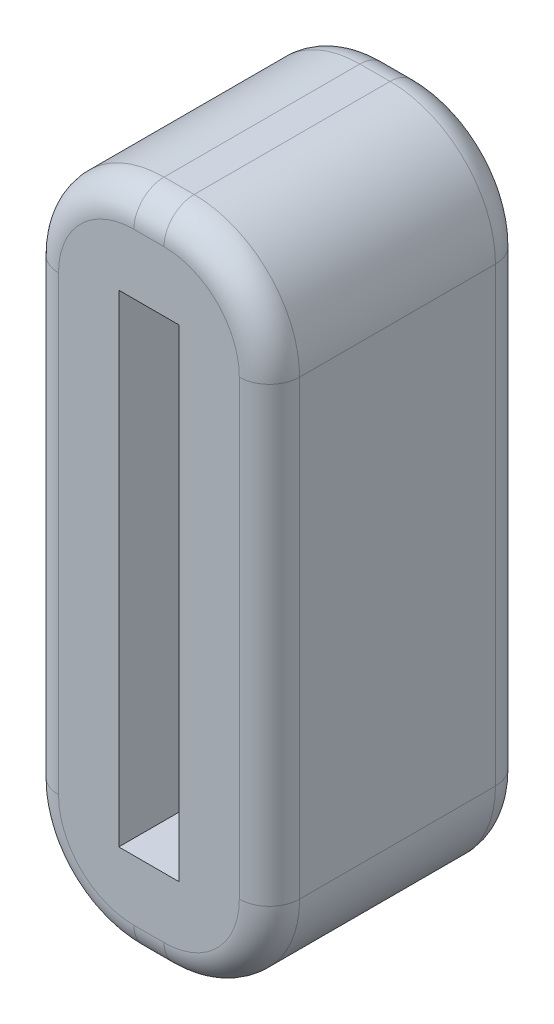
ISO-10303-21;
HEADER;
FILE_DESCRIPTION(('STEP AP214'),'2;1');
FILE_NAME('part.step','',(''),(''),'','','');
FILE_SCHEMA(('AUTOMOTIVE_DESIGN { 1 0 10303 214 1 1 1 1 }'));
ENDSEC;
DATA;
#1=APPLICATION_CONTEXT('core data for automotive mechanical design processes');
#2=APPLICATION_PROTOCOL_DEFINITION('international standard','automotive_design',2000,#1);
#3=PRODUCT_CONTEXT('',#1,'mechanical');
#4=PRODUCT('Part','Part','',(#3));
#5=PRODUCT_RELATED_PRODUCT_CATEGORY('part','',(#4));
#6=PRODUCT_DEFINITION_FORMATION('','',#4);
#7=PRODUCT_DEFINITION_CONTEXT('part definition',#1,'design');
#8=PRODUCT_DEFINITION('design','',#6,#7);
#9=PRODUCT_DEFINITION_SHAPE('','',#8);
#10=(LENGTH_UNIT() NAMED_UNIT(*) SI_UNIT(.MILLI.,.METRE.));
#11=(NAMED_UNIT(*) PLANE_ANGLE_UNIT() SI_UNIT($,.RADIAN.));
#12=(NAMED_UNIT(*) SI_UNIT($,.STERADIAN.) SOLID_ANGLE_UNIT());
#13=UNCERTAINTY_MEASURE_WITH_UNIT(LENGTH_MEASURE(1.E-05),#10,'distance_accuracy_value','');
#14=(GEOMETRIC_REPRESENTATION_CONTEXT(3) GLOBAL_UNCERTAINTY_ASSIGNED_CONTEXT((#13)) GLOBAL_UNIT_ASSIGNED_CONTEXT((#10,
#11,#12)) REPRESENTATION_CONTEXT('',''));
#15=CARTESIAN_POINT('',(0.,0.,0.));
#16=DIRECTION('',(0.,0.,1.));
#17=DIRECTION('',(1.,0.,0.));
#18=AXIS2_PLACEMENT_3D('',#15,#16,#17);
#19=CARTESIAN_POINT('',(0.749999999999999,0.249999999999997,4.25));
#20=DIRECTION('',(0.,0.,-1.));
#21=DIRECTION('',(-1.,0.,0.));
#22=AXIS2_PLACEMENT_3D('',#19,#20,#21);
#23=PLANE('',#22);
#24=DIRECTION('',(1.,0.,0.));
#25=VECTOR('',#24,1.);
#26=CARTESIAN_POINT('',(0.749999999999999,-1.,4.25));
#27=LINE('',#26,#25);
#28=CARTESIAN_POINT('',(0.250000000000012,-1.,4.25));
#29=VERTEX_POINT('',#28);
#30=CARTESIAN_POINT('',(0.74999999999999,-1.,4.25));
#31=VERTEX_POINT('',#30);
#32=EDGE_CURVE('E49',#29,#31,#27,.T.);
#33=ORIENTED_EDGE('',*,*,#32,.T.);
#34=CARTESIAN_POINT('',(0.749999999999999,0.249999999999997,4.25));
#35=DIRECTION('',(0.,0.,-1.));
#36=DIRECTION('',(-1.,0.,0.));
#37=AXIS2_PLACEMENT_3D('',#34,#35,#36);
#38=CIRCLE('',#37,1.25);
#39=CARTESIAN_POINT('',(2.,0.250000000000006,4.25));
#40=VERTEX_POINT('',#39);
#41=EDGE_CURVE('E295',#31,#40,#38,.F.);
#42=ORIENTED_EDGE('',*,*,#41,.T.);
#43=DIRECTION('',(0.,1.,0.));
#44=VECTOR('',#43,1.);
#45=CARTESIAN_POINT('',(2.,0.249999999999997,4.25));
#46=LINE('',#45,#44);
#47=CARTESIAN_POINT('',(2.,7.74999999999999,4.25));
#48=VERTEX_POINT('',#47);
#49=EDGE_CURVE('E283',#40,#48,#46,.T.);
#50=ORIENTED_EDGE('',*,*,#49,.T.);
#51=CARTESIAN_POINT('',(0.749999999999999,7.75,4.25));
#52=DIRECTION('',(0.,0.,-1.));
#53=DIRECTION('',(-1.,0.,0.));
#54=AXIS2_PLACEMENT_3D('',#51,#52,#53);
#55=CIRCLE('',#54,1.25);
#56=CARTESIAN_POINT('',(0.749999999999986,9.,4.25));
#57=VERTEX_POINT('',#56);
#58=EDGE_CURVE('E285',#48,#57,#55,.F.);
#59=ORIENTED_EDGE('',*,*,#58,.T.);
#60=DIRECTION('',(-1.,0.,0.));
#61=VECTOR('',#60,1.);
#62=CARTESIAN_POINT('',(0.749999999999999,9.,4.25));
#63=LINE('',#62,#61);
#64=CARTESIAN_POINT('',(0.250000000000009,9.,4.25));
#65=VERTEX_POINT('',#64);
#66=EDGE_CURVE('E287',#57,#65,#63,.T.);
#67=ORIENTED_EDGE('',*,*,#66,.T.);
#68=CARTESIAN_POINT('',(0.25,7.75,4.25));
#69=DIRECTION('',(0.,0.,-1.));
#70=DIRECTION('',(-1.,0.,0.));
#71=AXIS2_PLACEMENT_3D('',#68,#69,#70);
#72=CIRCLE('',#71,1.25);
#73=CARTESIAN_POINT('',(-1.,7.74999999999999,4.25));
#74=VERTEX_POINT('',#73);
#75=EDGE_CURVE('E289',#65,#74,#72,.F.);
#76=ORIENTED_EDGE('',*,*,#75,.T.);
#77=DIRECTION('',(0.,-1.,0.));
#78=VECTOR('',#77,1.);
#79=CARTESIAN_POINT('',(-1.,0.249999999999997,4.25));
#80=LINE('',#79,#78);
#81=CARTESIAN_POINT('',(-1.,0.250000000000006,4.25));
#82=VERTEX_POINT('',#81);
#83=EDGE_CURVE('E291',#74,#82,#80,.T.);
#84=ORIENTED_EDGE('',*,*,#83,.T.);
#85=CARTESIAN_POINT('',(0.25,0.249999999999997,4.25));
#86=DIRECTION('',(0.,0.,-1.));
#87=DIRECTION('',(-1.,0.,0.));
#88=AXIS2_PLACEMENT_3D('',#85,#86,#87);
#89=CIRCLE('',#88,1.25);
#90=EDGE_CURVE('E54',#82,#29,#89,.F.);
#91=ORIENTED_EDGE('',*,*,#90,.T.);
#92=EDGE_LOOP('',(#33,#42,#50,#59,#67,#76,#84,#91));
#93=FACE_BOUND('',#92,.T.);
#94=DIRECTION('',(1.,0.,0.));
#95=VECTOR('',#94,1.);
#96=CARTESIAN_POINT('',(1.,0.,4.25));
#97=LINE('',#96,#95);
#98=CARTESIAN_POINT('',(0.,0.,4.25));
#99=VERTEX_POINT('',#98);
#100=CARTESIAN_POINT('',(1.,0.,4.25));
#101=VERTEX_POINT('',#100);
#102=EDGE_CURVE('E171',#99,#101,#97,.T.);
#103=ORIENTED_EDGE('',*,*,#102,.F.);
#104=DIRECTION('',(0.,-1.,0.));
#105=VECTOR('',#104,1.);
#106=CARTESIAN_POINT('',(0.,0.,4.25));
#107=LINE('',#106,#105);
#108=CARTESIAN_POINT('',(0.,8.,4.25));
#109=VERTEX_POINT('',#108);
#110=EDGE_CURVE('E196',#109,#99,#107,.T.);
#111=ORIENTED_EDGE('',*,*,#110,.F.);
#112=DIRECTION('',(-1.,0.,0.));
#113=VECTOR('',#112,1.);
#114=CARTESIAN_POINT('',(0.,8.,4.25));
#115=LINE('',#114,#113);
#116=CARTESIAN_POINT('',(0.999999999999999,8.,4.25));
#117=VERTEX_POINT('',#116);
#118=EDGE_CURVE('E194',#117,#109,#115,.T.);
#119=ORIENTED_EDGE('',*,*,#118,.F.);
#120=DIRECTION('',(0.,1.,0.));
#121=VECTOR('',#120,1.);
#122=CARTESIAN_POINT('',(0.999999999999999,8.,4.25));
#123=LINE('',#122,#121);
#124=EDGE_CURVE('E181',#101,#117,#123,.T.);
#125=ORIENTED_EDGE('',*,*,#124,.F.);
#126=EDGE_LOOP('',(#103,#111,#119,#125));
#127=FACE_BOUND('',#126,.T.);
#128=ADVANCED_FACE('F32',(#93,#127),#23,.F.);
#129=CARTESIAN_POINT('',(0.749999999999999,0.249999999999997,0.));
#130=DIRECTION('',(0.,0.,-1.));
#131=DIRECTION('',(-1.,0.,0.));
#132=AXIS2_PLACEMENT_3D('',#129,#130,#131);
#133=PLANE('',#132);
#134=DIRECTION('',(0.,1.,0.));
#135=VECTOR('',#134,1.);
#136=CARTESIAN_POINT('',(2.,0.250000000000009,0.));
#137=LINE('',#136,#135);
#138=CARTESIAN_POINT('',(2.,7.74999999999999,0.));
#139=VERTEX_POINT('',#138);
#140=CARTESIAN_POINT('',(2.,0.250000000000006,0.));
#141=VERTEX_POINT('',#140);
#142=EDGE_CURVE('E242',#139,#141,#137,.F.);
#143=ORIENTED_EDGE('',*,*,#142,.T.);
#144=CARTESIAN_POINT('',(0.749999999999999,0.249999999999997,0.));
#145=DIRECTION('',(0.,0.,-1.));
#146=DIRECTION('',(-1.,0.,0.));
#147=AXIS2_PLACEMENT_3D('',#144,#145,#146);
#148=CIRCLE('',#147,1.25);
#149=CARTESIAN_POINT('',(0.74999999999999,-1.,0.));
#150=VERTEX_POINT('',#149);
#151=EDGE_CURVE('E256',#141,#150,#148,.T.);
#152=ORIENTED_EDGE('',*,*,#151,.T.);
#153=DIRECTION('',(1.,0.,0.));
#154=VECTOR('',#153,1.);
#155=CARTESIAN_POINT('',(0.250000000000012,-1.,0.));
#156=LINE('',#155,#154);
#157=CARTESIAN_POINT('',(0.250000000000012,-1.,0.));
#158=VERTEX_POINT('',#157);
#159=EDGE_CURVE('E254',#150,#158,#156,.F.);
#160=ORIENTED_EDGE('',*,*,#159,.T.);
#161=CARTESIAN_POINT('',(0.25,0.249999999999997,0.));
#162=DIRECTION('',(0.,0.,-1.));
#163=DIRECTION('',(-1.,0.,0.));
#164=AXIS2_PLACEMENT_3D('',#161,#162,#163);
#165=CIRCLE('',#164,1.25);
#166=CARTESIAN_POINT('',(-1.,0.250000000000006,0.));
#167=VERTEX_POINT('',#166);
#168=EDGE_CURVE('E252',#158,#167,#165,.T.);
#169=ORIENTED_EDGE('',*,*,#168,.T.);
#170=DIRECTION('',(0.,-1.,0.));
#171=VECTOR('',#170,1.);
#172=CARTESIAN_POINT('',(-1.,7.74999999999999,0.));
#173=LINE('',#172,#171);
#174=CARTESIAN_POINT('',(-1.,7.74999999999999,0.));
#175=VERTEX_POINT('',#174);
#176=EDGE_CURVE('E250',#167,#175,#173,.F.);
#177=ORIENTED_EDGE('',*,*,#176,.T.);
#178=CARTESIAN_POINT('',(0.25,7.75,0.));
#179=DIRECTION('',(0.,0.,-1.));
#180=DIRECTION('',(-1.,0.,0.));
#181=AXIS2_PLACEMENT_3D('',#178,#179,#180);
#182=CIRCLE('',#181,1.25);
#183=CARTESIAN_POINT('',(0.250000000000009,9.,0.));
#184=VERTEX_POINT('',#183);
#185=EDGE_CURVE('E248',#175,#184,#182,.T.);
#186=ORIENTED_EDGE('',*,*,#185,.T.);
#187=DIRECTION('',(-1.,0.,0.));
#188=VECTOR('',#187,1.);
#189=CARTESIAN_POINT('',(0.749999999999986,9.,0.));
#190=LINE('',#189,#188);
#191=CARTESIAN_POINT('',(0.749999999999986,9.,0.));
#192=VERTEX_POINT('',#191);
#193=EDGE_CURVE('E246',#184,#192,#190,.F.);
#194=ORIENTED_EDGE('',*,*,#193,.T.);
#195=CARTESIAN_POINT('',(0.749999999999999,7.75,0.));
#196=DIRECTION('',(0.,0.,-1.));
#197=DIRECTION('',(-1.,0.,0.));
#198=AXIS2_PLACEMENT_3D('',#195,#196,#197);
#199=CIRCLE('',#198,1.25);
#200=EDGE_CURVE('E244',#192,#139,#199,.T.);
#201=ORIENTED_EDGE('',*,*,#200,.T.);
#202=EDGE_LOOP('',(#143,#152,#160,#169,#177,#186,#194,#201));
#203=FACE_BOUND('',#202,.T.);
#204=DIRECTION('',(0.,-1.,0.));
#205=VECTOR('',#204,1.);
#206=CARTESIAN_POINT('',(0.,0.,0.));
#207=LINE('',#206,#205);
#208=CARTESIAN_POINT('',(0.,8.,0.));
#209=VERTEX_POINT('',#208);
#210=CARTESIAN_POINT('',(0.,0.,0.));
#211=VERTEX_POINT('',#210);
#212=EDGE_CURVE('E182',#209,#211,#207,.T.);
#213=ORIENTED_EDGE('',*,*,#212,.T.);
#214=DIRECTION('',(1.,0.,0.));
#215=VECTOR('',#214,1.);
#216=CARTESIAN_POINT('',(1.,0.,0.));
#217=LINE('',#216,#215);
#218=CARTESIAN_POINT('',(1.,0.,0.));
#219=VERTEX_POINT('',#218);
#220=EDGE_CURVE('E200',#211,#219,#217,.T.);
#221=ORIENTED_EDGE('',*,*,#220,.T.);
#222=DIRECTION('',(0.,1.,0.));
#223=VECTOR('',#222,1.);
#224=CARTESIAN_POINT('',(0.999999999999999,8.,0.));
#225=LINE('',#224,#223);
#226=CARTESIAN_POINT('',(0.999999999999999,8.,0.));
#227=VERTEX_POINT('',#226);
#228=EDGE_CURVE('E188',#219,#227,#225,.T.);
#229=ORIENTED_EDGE('',*,*,#228,.T.);
#230=DIRECTION('',(-1.,0.,0.));
#231=VECTOR('',#230,1.);
#232=CARTESIAN_POINT('',(0.,8.,0.));
#233=LINE('',#232,#231);
#234=EDGE_CURVE('E204',#227,#209,#233,.T.);
#235=ORIENTED_EDGE('',*,*,#234,.T.);
#236=EDGE_LOOP('',(#213,#221,#229,#235));
#237=FACE_BOUND('',#236,.T.);
#238=ADVANCED_FACE('F371',(#203,#237),#133,.T.);
#239=CARTESIAN_POINT('',(0.749999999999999,0.249999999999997,4.25));
#240=DIRECTION('',(0.,0.,-1.));
#241=DIRECTION('',(-1.,0.,0.));
#242=AXIS2_PLACEMENT_3D('',#239,#240,#241);
#243=CYLINDRICAL_SURFACE('',#242,1.75);
#244=DIRECTION('',(0.,0.,-1.));
#245=VECTOR('',#244,1.);
#246=CARTESIAN_POINT('',(0.749999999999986,-1.5,4.25));
#247=LINE('',#246,#245);
#248=CARTESIAN_POINT('',(0.749999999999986,-1.5,3.75));
#249=VERTEX_POINT('',#248);
#250=CARTESIAN_POINT('',(0.749999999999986,-1.5,0.5));
#251=VERTEX_POINT('',#250);
#252=EDGE_CURVE('E189',#249,#251,#247,.T.);
#253=ORIENTED_EDGE('',*,*,#252,.T.);
#254=CARTESIAN_POINT('',(0.749999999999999,0.249999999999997,0.5));
#255=DIRECTION('',(0.,0.,-1.));
#256=DIRECTION('',(-1.,0.,0.));
#257=AXIS2_PLACEMENT_3D('',#254,#255,#256);
#258=CIRCLE('',#257,1.75);
#259=CARTESIAN_POINT('',(2.5,0.250000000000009,0.5));
#260=VERTEX_POINT('',#259);
#261=EDGE_CURVE('E239',#251,#260,#258,.F.);
#262=ORIENTED_EDGE('',*,*,#261,.T.);
#263=DIRECTION('',(0.,0.,-1.));
#264=VECTOR('',#263,1.);
#265=CARTESIAN_POINT('',(2.5,0.250000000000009,4.25));
#266=LINE('',#265,#264);
#267=CARTESIAN_POINT('',(2.5,0.250000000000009,3.75));
#268=VERTEX_POINT('',#267);
#269=EDGE_CURVE('E233',#268,#260,#266,.T.);
#270=ORIENTED_EDGE('',*,*,#269,.F.);
#271=CARTESIAN_POINT('',(0.749999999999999,0.249999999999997,3.75));
#272=DIRECTION('',(0.,0.,-1.));
#273=DIRECTION('',(-1.,0.,0.));
#274=AXIS2_PLACEMENT_3D('',#271,#272,#273);
#275=CIRCLE('',#274,1.75);
#276=EDGE_CURVE('E236',#268,#249,#275,.T.);
#277=ORIENTED_EDGE('',*,*,#276,.T.);
#278=EDGE_LOOP('',(#253,#262,#270,#277));
#279=FACE_BOUND('',#278,.T.);
#280=ADVANCED_FACE('F405',(#279),#243,.T.);
#281=CARTESIAN_POINT('',(2.5,7.74999999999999,4.25));
#282=DIRECTION('',(-1.,0.,0.));
#283=DIRECTION('',(0.,0.,1.));
#284=AXIS2_PLACEMENT_3D('',#281,#282,#283);
#285=PLANE('',#284);
#286=ORIENTED_EDGE('',*,*,#269,.T.);
#287=DIRECTION('',(0.,1.,0.));
#288=VECTOR('',#287,1.);
#289=CARTESIAN_POINT('',(2.5,7.74999999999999,0.5));
#290=LINE('',#289,#288);
#291=CARTESIAN_POINT('',(2.5,7.74999999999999,0.5));
#292=VERTEX_POINT('',#291);
#293=EDGE_CURVE('E11',#260,#292,#290,.T.);
#294=ORIENTED_EDGE('',*,*,#293,.T.);
#295=DIRECTION('',(0.,0.,-1.));
#296=VECTOR('',#295,1.);
#297=CARTESIAN_POINT('',(2.5,7.74999999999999,4.25));
#298=LINE('',#297,#296);
#299=CARTESIAN_POINT('',(2.5,7.74999999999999,3.75));
#300=VERTEX_POINT('',#299);
#301=EDGE_CURVE('E230',#300,#292,#298,.T.);
#302=ORIENTED_EDGE('',*,*,#301,.F.);
#303=DIRECTION('',(0.,1.,0.));
#304=VECTOR('',#303,1.);
#305=CARTESIAN_POINT('',(2.5,7.74999999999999,3.75));
#306=LINE('',#305,#304);
#307=EDGE_CURVE('E41',#300,#268,#306,.F.);
#308=ORIENTED_EDGE('',*,*,#307,.T.);
#309=EDGE_LOOP('',(#286,#294,#302,#308));
#310=FACE_BOUND('',#309,.T.);
#311=ADVANCED_FACE('F441',(#310),#285,.F.);
#312=CARTESIAN_POINT('',(0.749999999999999,7.75,4.25));
#313=DIRECTION('',(0.,0.,-1.));
#314=DIRECTION('',(-1.,0.,0.));
#315=AXIS2_PLACEMENT_3D('',#312,#313,#314);
#316=CYLINDRICAL_SURFACE('',#315,1.75);
#317=ORIENTED_EDGE('',*,*,#301,.T.);
#318=CARTESIAN_POINT('',(0.749999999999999,7.75,0.5));
#319=DIRECTION('',(0.,0.,-1.));
#320=DIRECTION('',(-1.,0.,0.));
#321=AXIS2_PLACEMENT_3D('',#318,#319,#320);
#322=CIRCLE('',#321,1.75);
#323=CARTESIAN_POINT('',(0.749999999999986,9.5,0.5));
#324=VERTEX_POINT('',#323);
#325=EDGE_CURVE('E281',#292,#324,#322,.F.);
#326=ORIENTED_EDGE('',*,*,#325,.T.);
#327=DIRECTION('',(0.,0.,-1.));
#328=VECTOR('',#327,1.);
#329=CARTESIAN_POINT('',(0.749999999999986,9.5,4.25));
#330=LINE('',#329,#328);
#331=CARTESIAN_POINT('',(0.749999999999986,9.5,3.75));
#332=VERTEX_POINT('',#331);
#333=EDGE_CURVE('E227',#332,#324,#330,.T.);
#334=ORIENTED_EDGE('',*,*,#333,.F.);
#335=CARTESIAN_POINT('',(0.749999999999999,7.75,3.75));
#336=DIRECTION('',(0.,0.,-1.));
#337=DIRECTION('',(-1.,0.,0.));
#338=AXIS2_PLACEMENT_3D('',#335,#336,#337);
#339=CIRCLE('',#338,1.75);
#340=EDGE_CURVE('E279',#332,#300,#339,.T.);
#341=ORIENTED_EDGE('',*,*,#340,.T.);
#342=EDGE_LOOP('',(#317,#326,#334,#341));
#343=FACE_BOUND('',#342,.T.);
#344=ADVANCED_FACE('F438',(#343),#316,.T.);
#345=CARTESIAN_POINT('',(0.250000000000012,9.5,4.25));
#346=DIRECTION('',(0.,-1.,0.));
#347=DIRECTION('',(0.,0.,-1.));
#348=AXIS2_PLACEMENT_3D('',#345,#346,#347);
#349=PLANE('',#348);
#350=ORIENTED_EDGE('',*,*,#333,.T.);
#351=DIRECTION('',(-1.,0.,0.));
#352=VECTOR('',#351,1.);
#353=CARTESIAN_POINT('',(0.250000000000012,9.5,0.5));
#354=LINE('',#353,#352);
#355=CARTESIAN_POINT('',(0.250000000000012,9.5,0.5));
#356=VERTEX_POINT('',#355);
#357=EDGE_CURVE('E277',#324,#356,#354,.T.);
#358=ORIENTED_EDGE('',*,*,#357,.T.);
#359=DIRECTION('',(0.,0.,-1.));
#360=VECTOR('',#359,1.);
#361=CARTESIAN_POINT('',(0.250000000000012,9.5,4.25));
#362=LINE('',#361,#360);
#363=CARTESIAN_POINT('',(0.250000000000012,9.5,3.75));
#364=VERTEX_POINT('',#363);
#365=EDGE_CURVE('E224',#364,#356,#362,.T.);
#366=ORIENTED_EDGE('',*,*,#365,.F.);
#367=DIRECTION('',(-1.,0.,0.));
#368=VECTOR('',#367,1.);
#369=CARTESIAN_POINT('',(0.250000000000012,9.5,3.75));
#370=LINE('',#369,#368);
#371=EDGE_CURVE('E275',#364,#332,#370,.F.);
#372=ORIENTED_EDGE('',*,*,#371,.T.);
#373=EDGE_LOOP('',(#350,#358,#366,#372));
#374=FACE_BOUND('',#373,.T.);
#375=ADVANCED_FACE('F356',(#374),#349,.F.);
#376=CARTESIAN_POINT('',(0.25,7.75,4.25));
#377=DIRECTION('',(0.,0.,-1.));
#378=DIRECTION('',(-1.,0.,0.));
#379=AXIS2_PLACEMENT_3D('',#376,#377,#378);
#380=CYLINDRICAL_SURFACE('',#379,1.75);
#381=ORIENTED_EDGE('',*,*,#365,.T.);
#382=CARTESIAN_POINT('',(0.25,7.75,0.5));
#383=DIRECTION('',(0.,0.,-1.));
#384=DIRECTION('',(-1.,0.,0.));
#385=AXIS2_PLACEMENT_3D('',#382,#383,#384);
#386=CIRCLE('',#385,1.75);
#387=CARTESIAN_POINT('',(-1.5,7.74999999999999,0.5));
#388=VERTEX_POINT('',#387);
#389=EDGE_CURVE('E273',#356,#388,#386,.F.);
#390=ORIENTED_EDGE('',*,*,#389,.T.);
#391=DIRECTION('',(0.,0.,-1.));
#392=VECTOR('',#391,1.);
#393=CARTESIAN_POINT('',(-1.5,7.74999999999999,4.25));
#394=LINE('',#393,#392);
#395=CARTESIAN_POINT('',(-1.5,7.74999999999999,3.75));
#396=VERTEX_POINT('',#395);
#397=EDGE_CURVE('E221',#396,#388,#394,.T.);
#398=ORIENTED_EDGE('',*,*,#397,.F.);
#399=CARTESIAN_POINT('',(0.25,7.75,3.75));
#400=DIRECTION('',(0.,0.,-1.));
#401=DIRECTION('',(-1.,0.,0.));
#402=AXIS2_PLACEMENT_3D('',#399,#400,#401);
#403=CIRCLE('',#402,1.75);
#404=EDGE_CURVE('E271',#396,#364,#403,.T.);
#405=ORIENTED_EDGE('',*,*,#404,.T.);
#406=EDGE_LOOP('',(#381,#390,#398,#405));
#407=FACE_BOUND('',#406,.T.);
#408=ADVANCED_FACE('F353',(#407),#380,.T.);
#409=CARTESIAN_POINT('',(-1.5,0.250000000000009,4.25));
#410=DIRECTION('',(1.,0.,0.));
#411=DIRECTION('',(0.,0.,-1.));
#412=AXIS2_PLACEMENT_3D('',#409,#410,#411);
#413=PLANE('',#412);
#414=ORIENTED_EDGE('',*,*,#397,.T.);
#415=DIRECTION('',(0.,-1.,0.));
#416=VECTOR('',#415,1.);
#417=CARTESIAN_POINT('',(-1.5,0.250000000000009,0.5));
#418=LINE('',#417,#416);
#419=CARTESIAN_POINT('',(-1.5,0.250000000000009,0.5));
#420=VERTEX_POINT('',#419);
#421=EDGE_CURVE('E269',#388,#420,#418,.T.);
#422=ORIENTED_EDGE('',*,*,#421,.T.);
#423=DIRECTION('',(0.,0.,-1.));
#424=VECTOR('',#423,1.);
#425=CARTESIAN_POINT('',(-1.5,0.250000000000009,4.25));
#426=LINE('',#425,#424);
#427=CARTESIAN_POINT('',(-1.5,0.250000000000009,3.75));
#428=VERTEX_POINT('',#427);
#429=EDGE_CURVE('E218',#428,#420,#426,.T.);
#430=ORIENTED_EDGE('',*,*,#429,.F.);
#431=DIRECTION('',(0.,-1.,0.));
#432=VECTOR('',#431,1.);
#433=CARTESIAN_POINT('',(-1.5,0.250000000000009,3.75));
#434=LINE('',#433,#432);
#435=EDGE_CURVE('E267',#428,#396,#434,.F.);
#436=ORIENTED_EDGE('',*,*,#435,.T.);
#437=EDGE_LOOP('',(#414,#422,#430,#436));
#438=FACE_BOUND('',#437,.T.);
#439=ADVANCED_FACE('F381',(#438),#413,.F.);
#440=CARTESIAN_POINT('',(0.25,0.249999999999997,4.25));
#441=DIRECTION('',(0.,0.,-1.));
#442=DIRECTION('',(-1.,0.,0.));
#443=AXIS2_PLACEMENT_3D('',#440,#441,#442);
#444=CYLINDRICAL_SURFACE('',#443,1.75);
#445=ORIENTED_EDGE('',*,*,#429,.T.);
#446=CARTESIAN_POINT('',(0.25,0.249999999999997,0.5));
#447=DIRECTION('',(0.,0.,-1.));
#448=DIRECTION('',(-1.,0.,0.));
#449=AXIS2_PLACEMENT_3D('',#446,#447,#448);
#450=CIRCLE('',#449,1.75);
#451=CARTESIAN_POINT('',(0.250000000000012,-1.5,0.5));
#452=VERTEX_POINT('',#451);
#453=EDGE_CURVE('E265',#420,#452,#450,.F.);
#454=ORIENTED_EDGE('',*,*,#453,.T.);
#455=DIRECTION('',(0.,0.,-1.));
#456=VECTOR('',#455,1.);
#457=CARTESIAN_POINT('',(0.250000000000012,-1.5,4.25));
#458=LINE('',#457,#456);
#459=CARTESIAN_POINT('',(0.250000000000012,-1.5,3.75));
#460=VERTEX_POINT('',#459);
#461=EDGE_CURVE('E215',#460,#452,#458,.T.);
#462=ORIENTED_EDGE('',*,*,#461,.F.);
#463=CARTESIAN_POINT('',(0.25,0.249999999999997,3.75));
#464=DIRECTION('',(0.,0.,-1.));
#465=DIRECTION('',(-1.,0.,0.));
#466=AXIS2_PLACEMENT_3D('',#463,#464,#465);
#467=CIRCLE('',#466,1.75);
#468=EDGE_CURVE('E263',#460,#428,#467,.T.);
#469=ORIENTED_EDGE('',*,*,#468,.T.);
#470=EDGE_LOOP('',(#445,#454,#462,#469));
#471=FACE_BOUND('',#470,.T.);
#472=ADVANCED_FACE('F385',(#471),#444,.T.);
#473=CARTESIAN_POINT('',(0.749999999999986,-1.5,4.25));
#474=DIRECTION('',(0.,1.,0.));
#475=DIRECTION('',(0.,0.,1.));
#476=AXIS2_PLACEMENT_3D('',#473,#474,#475);
#477=PLANE('',#476);
#478=ORIENTED_EDGE('',*,*,#461,.T.);
#479=DIRECTION('',(1.,0.,0.));
#480=VECTOR('',#479,1.);
#481=CARTESIAN_POINT('',(0.749999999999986,-1.5,0.5));
#482=LINE('',#481,#480);
#483=EDGE_CURVE('E261',#452,#251,#482,.T.);
#484=ORIENTED_EDGE('',*,*,#483,.T.);
#485=ORIENTED_EDGE('',*,*,#252,.F.);
#486=DIRECTION('',(1.,0.,0.));
#487=VECTOR('',#486,1.);
#488=CARTESIAN_POINT('',(0.749999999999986,-1.5,3.75));
#489=LINE('',#488,#487);
#490=EDGE_CURVE('E259',#249,#460,#489,.F.);
#491=ORIENTED_EDGE('',*,*,#490,.T.);
#492=EDGE_LOOP('',(#478,#484,#485,#491));
#493=FACE_BOUND('',#492,.T.);
#494=ADVANCED_FACE('F403',(#493),#477,.F.);
#495=CARTESIAN_POINT('',(1.,0.,4.25));
#496=DIRECTION('',(0.,1.,0.));
#497=DIRECTION('',(-1.,0.,0.));
#498=AXIS2_PLACEMENT_3D('',#495,#496,#497);
#499=PLANE('',#498);
#500=ORIENTED_EDGE('',*,*,#220,.F.);
#501=DIRECTION('',(0.,0.,-1.));
#502=VECTOR('',#501,1.);
#503=CARTESIAN_POINT('',(0.,0.,4.25));
#504=LINE('',#503,#502);
#505=EDGE_CURVE('E177',#99,#211,#504,.T.);
#506=ORIENTED_EDGE('',*,*,#505,.F.);
#507=ORIENTED_EDGE('',*,*,#102,.T.);
#508=DIRECTION('',(0.,0.,-1.));
#509=VECTOR('',#508,1.);
#510=CARTESIAN_POINT('',(1.,0.,4.25));
#511=LINE('',#510,#509);
#512=EDGE_CURVE('E174',#101,#219,#511,.T.);
#513=ORIENTED_EDGE('',*,*,#512,.T.);
#514=EDGE_LOOP('',(#500,#506,#507,#513));
#515=FACE_BOUND('',#514,.T.);
#516=ADVANCED_FACE('F173',(#515),#499,.T.);
#517=CARTESIAN_POINT('',(0.999999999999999,8.,4.25));
#518=DIRECTION('',(-1.,0.,0.));
#519=DIRECTION('',(0.,-1.,0.));
#520=AXIS2_PLACEMENT_3D('',#517,#518,#519);
#521=PLANE('',#520);
#522=ORIENTED_EDGE('',*,*,#228,.F.);
#523=ORIENTED_EDGE('',*,*,#512,.F.);
#524=ORIENTED_EDGE('',*,*,#124,.T.);
#525=DIRECTION('',(0.,0.,-1.));
#526=VECTOR('',#525,1.);
#527=CARTESIAN_POINT('',(0.999999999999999,8.,4.25));
#528=LINE('',#527,#526);
#529=EDGE_CURVE('E190',#117,#227,#528,.T.);
#530=ORIENTED_EDGE('',*,*,#529,.T.);
#531=EDGE_LOOP('',(#522,#523,#524,#530));
#532=FACE_BOUND('',#531,.T.);
#533=ADVANCED_FACE('F185',(#532),#521,.T.);
#534=CARTESIAN_POINT('',(0.,8.,4.25));
#535=DIRECTION('',(0.,-1.,0.));
#536=DIRECTION('',(0.,0.,-1.));
#537=AXIS2_PLACEMENT_3D('',#534,#535,#536);
#538=PLANE('',#537);
#539=ORIENTED_EDGE('',*,*,#234,.F.);
#540=ORIENTED_EDGE('',*,*,#529,.F.);
#541=ORIENTED_EDGE('',*,*,#118,.T.);
#542=DIRECTION('',(0.,0.,-1.));
#543=VECTOR('',#542,1.);
#544=CARTESIAN_POINT('',(0.,8.,4.25));
#545=LINE('',#544,#543);
#546=EDGE_CURVE('E210',#109,#209,#545,.T.);
#547=ORIENTED_EDGE('',*,*,#546,.T.);
#548=EDGE_LOOP('',(#539,#540,#541,#547));
#549=FACE_BOUND('',#548,.T.);
#550=ADVANCED_FACE('F532',(#549),#538,.T.);
#551=CARTESIAN_POINT('',(0.,0.,4.25));
#552=DIRECTION('',(1.,0.,0.));
#553=DIRECTION('',(0.,0.,-1.));
#554=AXIS2_PLACEMENT_3D('',#551,#552,#553);
#555=PLANE('',#554);
#556=ORIENTED_EDGE('',*,*,#212,.F.);
#557=ORIENTED_EDGE('',*,*,#546,.F.);
#558=ORIENTED_EDGE('',*,*,#110,.T.);
#559=ORIENTED_EDGE('',*,*,#505,.T.);
#560=EDGE_LOOP('',(#556,#557,#558,#559));
#561=FACE_BOUND('',#560,.T.);
#562=ADVANCED_FACE('F468',(#561),#555,.T.);
#563=CARTESIAN_POINT('',(0.25,7.75,0.5));
#564=DIRECTION('',(0.,0.,-1.));
#565=DIRECTION('',(-1.,0.,0.));
#566=AXIS2_PLACEMENT_3D('',#563,#564,#565);
#567=TOROIDAL_SURFACE('',#566,1.25,0.5);
#568=CARTESIAN_POINT('',(0.250000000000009,9.,0.5));
#569=DIRECTION('',(1.,0.,0.));
#570=DIRECTION('',(0.,1.,0.));
#571=AXIS2_PLACEMENT_3D('',#568,#569,#570);
#572=CIRCLE('',#571,0.5);
#573=EDGE_CURVE('E314',#184,#356,#572,.T.);
#574=ORIENTED_EDGE('',*,*,#573,.F.);
#575=ORIENTED_EDGE('',*,*,#185,.F.);
#576=CARTESIAN_POINT('',(-1.,7.74999999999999,0.5));
#577=DIRECTION('',(0.,-1.,0.));
#578=DIRECTION('',(0.,0.,-1.));
#579=AXIS2_PLACEMENT_3D('',#576,#577,#578);
#580=CIRCLE('',#579,0.5);
#581=EDGE_CURVE('E202',#388,#175,#580,.T.);
#582=ORIENTED_EDGE('',*,*,#581,.F.);
#583=ORIENTED_EDGE('',*,*,#389,.F.);
#584=EDGE_LOOP('',(#574,#575,#582,#583));
#585=FACE_BOUND('',#584,.T.);
#586=ADVANCED_FACE('F378',(#585),#567,.T.);
#587=CARTESIAN_POINT('',(-1.,0.250000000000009,0.5));
#588=DIRECTION('',(0.,1.,0.));
#589=DIRECTION('',(0.,0.,1.));
#590=AXIS2_PLACEMENT_3D('',#587,#588,#589);
#591=CYLINDRICAL_SURFACE('',#590,0.5);
#592=ORIENTED_EDGE('',*,*,#581,.T.);
#593=ORIENTED_EDGE('',*,*,#176,.F.);
#594=CARTESIAN_POINT('',(-1.,0.250000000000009,0.5));
#595=DIRECTION('',(0.,-1.,0.));
#596=DIRECTION('',(0.,0.,-1.));
#597=AXIS2_PLACEMENT_3D('',#594,#595,#596);
#598=CIRCLE('',#597,0.5);
#599=EDGE_CURVE('E311',#420,#167,#598,.T.);
#600=ORIENTED_EDGE('',*,*,#599,.F.);
#601=ORIENTED_EDGE('',*,*,#421,.F.);
#602=EDGE_LOOP('',(#592,#593,#600,#601));
#603=FACE_BOUND('',#602,.T.);
#604=ADVANCED_FACE('F390',(#603),#591,.T.);
#605=CARTESIAN_POINT('',(0.250000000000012,9.,0.5));
#606=DIRECTION('',(1.,0.,0.));
#607=DIRECTION('',(0.,0.,-1.));
#608=AXIS2_PLACEMENT_3D('',#605,#606,#607);
#609=CYLINDRICAL_SURFACE('',#608,0.5);
#610=ORIENTED_EDGE('',*,*,#573,.T.);
#611=ORIENTED_EDGE('',*,*,#357,.F.);
#612=CARTESIAN_POINT('',(0.749999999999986,9.,0.5));
#613=DIRECTION('',(1.,0.,0.));
#614=DIRECTION('',(0.,0.,-1.));
#615=AXIS2_PLACEMENT_3D('',#612,#613,#614);
#616=CIRCLE('',#615,0.5);
#617=EDGE_CURVE('E308',#192,#324,#616,.T.);
#618=ORIENTED_EDGE('',*,*,#617,.F.);
#619=ORIENTED_EDGE('',*,*,#193,.F.);
#620=EDGE_LOOP('',(#610,#611,#618,#619));
#621=FACE_BOUND('',#620,.T.);
#622=ADVANCED_FACE('F361',(#621),#609,.T.);
#623=CARTESIAN_POINT('',(0.25,0.249999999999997,0.5));
#624=DIRECTION('',(0.,0.,-1.));
#625=DIRECTION('',(-1.,0.,0.));
#626=AXIS2_PLACEMENT_3D('',#623,#624,#625);
#627=TOROIDAL_SURFACE('',#626,1.25,0.5);
#628=ORIENTED_EDGE('',*,*,#599,.T.);
#629=ORIENTED_EDGE('',*,*,#168,.F.);
#630=CARTESIAN_POINT('',(0.250000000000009,-1.,0.5));
#631=DIRECTION('',(1.,0.,0.));
#632=DIRECTION('',(0.,0.,-1.));
#633=AXIS2_PLACEMENT_3D('',#630,#631,#632);
#634=CIRCLE('',#633,0.5);
#635=EDGE_CURVE('E305',#452,#158,#634,.T.);
#636=ORIENTED_EDGE('',*,*,#635,.F.);
#637=ORIENTED_EDGE('',*,*,#453,.F.);
#638=EDGE_LOOP('',(#628,#629,#636,#637));
#639=FACE_BOUND('',#638,.T.);
#640=ADVANCED_FACE('F394',(#639),#627,.T.);
#641=CARTESIAN_POINT('',(0.749999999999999,7.75,0.5));
#642=DIRECTION('',(0.,0.,-1.));
#643=DIRECTION('',(-1.,0.,0.));
#644=AXIS2_PLACEMENT_3D('',#641,#642,#643);
#645=TOROIDAL_SURFACE('',#644,1.25,0.5);
#646=ORIENTED_EDGE('',*,*,#617,.T.);
#647=ORIENTED_EDGE('',*,*,#325,.F.);
#648=CARTESIAN_POINT('',(2.,7.74999999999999,0.5));
#649=DIRECTION('',(0.,-1.,0.));
#650=DIRECTION('',(1.,0.,0.));
#651=AXIS2_PLACEMENT_3D('',#648,#649,#650);
#652=CIRCLE('',#651,0.5);
#653=EDGE_CURVE('E302',#139,#292,#652,.T.);
#654=ORIENTED_EDGE('',*,*,#653,.F.);
#655=ORIENTED_EDGE('',*,*,#200,.F.);
#656=EDGE_LOOP('',(#646,#647,#654,#655));
#657=FACE_BOUND('',#656,.T.);
#658=ADVANCED_FACE('F367',(#657),#645,.T.);
#659=CARTESIAN_POINT('',(0.749999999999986,-1.,0.5));
#660=DIRECTION('',(-1.,0.,0.));
#661=DIRECTION('',(0.,0.,1.));
#662=AXIS2_PLACEMENT_3D('',#659,#660,#661);
#663=CYLINDRICAL_SURFACE('',#662,0.5);
#664=ORIENTED_EDGE('',*,*,#635,.T.);
#665=ORIENTED_EDGE('',*,*,#159,.F.);
#666=CARTESIAN_POINT('',(0.749999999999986,-1.,0.5));
#667=DIRECTION('',(1.,0.,0.));
#668=DIRECTION('',(0.,0.,-1.));
#669=AXIS2_PLACEMENT_3D('',#666,#667,#668);
#670=CIRCLE('',#669,0.5);
#671=EDGE_CURVE('E300',#251,#150,#670,.T.);
#672=ORIENTED_EDGE('',*,*,#671,.F.);
#673=ORIENTED_EDGE('',*,*,#483,.F.);
#674=EDGE_LOOP('',(#664,#665,#672,#673));
#675=FACE_BOUND('',#674,.T.);
#676=ADVANCED_FACE('F399',(#675),#663,.T.);
#677=CARTESIAN_POINT('',(2.,7.74999999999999,0.5));
#678=DIRECTION('',(0.,-1.,0.));
#679=DIRECTION('',(0.,0.,-1.));
#680=AXIS2_PLACEMENT_3D('',#677,#678,#679);
#681=CYLINDRICAL_SURFACE('',#680,0.5);
#682=ORIENTED_EDGE('',*,*,#653,.T.);
#683=ORIENTED_EDGE('',*,*,#293,.F.);
#684=CARTESIAN_POINT('',(2.,0.250000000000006,0.5));
#685=DIRECTION('',(0.,-1.,0.));
#686=DIRECTION('',(1.,0.,0.));
#687=AXIS2_PLACEMENT_3D('',#684,#685,#686);
#688=CIRCLE('',#687,0.5);
#689=EDGE_CURVE('E298',#141,#260,#688,.T.);
#690=ORIENTED_EDGE('',*,*,#689,.F.);
#691=ORIENTED_EDGE('',*,*,#142,.F.);
#692=EDGE_LOOP('',(#682,#683,#690,#691));
#693=FACE_BOUND('',#692,.T.);
#694=ADVANCED_FACE('F451',(#693),#681,.T.);
#695=CARTESIAN_POINT('',(0.749999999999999,0.249999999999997,0.5));
#696=DIRECTION('',(0.,0.,-1.));
#697=DIRECTION('',(-1.,0.,0.));
#698=AXIS2_PLACEMENT_3D('',#695,#696,#697);
#699=TOROIDAL_SURFACE('',#698,1.25,0.5);
#700=ORIENTED_EDGE('',*,*,#671,.T.);
#701=ORIENTED_EDGE('',*,*,#151,.F.);
#702=ORIENTED_EDGE('',*,*,#689,.T.);
#703=ORIENTED_EDGE('',*,*,#261,.F.);
#704=EDGE_LOOP('',(#700,#701,#702,#703));
#705=FACE_BOUND('',#704,.T.);
#706=ADVANCED_FACE('F448',(#705),#699,.T.);
#707=CARTESIAN_POINT('',(0.25,7.75,3.75));
#708=DIRECTION('',(0.,0.,-1.));
#709=DIRECTION('',(-1.,0.,0.));
#710=AXIS2_PLACEMENT_3D('',#707,#708,#709);
#711=TOROIDAL_SURFACE('',#710,1.25,0.5);
#712=CARTESIAN_POINT('',(0.250000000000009,9.,3.75));
#713=DIRECTION('',(1.,0.,0.));
#714=DIRECTION('',(0.,1.,0.));
#715=AXIS2_PLACEMENT_3D('',#712,#713,#714);
#716=CIRCLE('',#715,0.5);
#717=EDGE_CURVE('E334',#364,#65,#716,.T.);
#718=ORIENTED_EDGE('',*,*,#717,.F.);
#719=ORIENTED_EDGE('',*,*,#404,.F.);
#720=CARTESIAN_POINT('',(-1.,7.74999999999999,3.75));
#721=DIRECTION('',(0.,-1.,0.));
#722=DIRECTION('',(0.,0.,-1.));
#723=AXIS2_PLACEMENT_3D('',#720,#721,#722);
#724=CIRCLE('',#723,0.5);
#725=EDGE_CURVE('E36',#74,#396,#724,.T.);
#726=ORIENTED_EDGE('',*,*,#725,.F.);
#727=ORIENTED_EDGE('',*,*,#75,.F.);
#728=EDGE_LOOP('',(#718,#719,#726,#727));
#729=FACE_BOUND('',#728,.T.);
#730=ADVANCED_FACE('F34',(#729),#711,.T.);
#731=CARTESIAN_POINT('',(-1.,0.249999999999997,3.75));
#732=DIRECTION('',(0.,-1.,0.));
#733=DIRECTION('',(0.,0.,-1.));
#734=AXIS2_PLACEMENT_3D('',#731,#732,#733);
#735=CYLINDRICAL_SURFACE('',#734,0.5);
#736=ORIENTED_EDGE('',*,*,#725,.T.);
#737=ORIENTED_EDGE('',*,*,#435,.F.);
#738=CARTESIAN_POINT('',(-1.,0.250000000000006,3.75));
#739=DIRECTION('',(0.,-1.,0.));
#740=DIRECTION('',(1.,0.,0.));
#741=AXIS2_PLACEMENT_3D('',#738,#739,#740);
#742=CIRCLE('',#741,0.5);
#743=EDGE_CURVE('E332',#82,#428,#742,.T.);
#744=ORIENTED_EDGE('',*,*,#743,.F.);
#745=ORIENTED_EDGE('',*,*,#83,.F.);
#746=EDGE_LOOP('',(#736,#737,#744,#745));
#747=FACE_BOUND('',#746,.T.);
#748=ADVANCED_FACE('F345',(#747),#735,.T.);
#749=CARTESIAN_POINT('',(0.749999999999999,9.,3.75));
#750=DIRECTION('',(-1.,0.,0.));
#751=DIRECTION('',(0.,0.,1.));
#752=AXIS2_PLACEMENT_3D('',#749,#750,#751);
#753=CYLINDRICAL_SURFACE('',#752,0.5);
#754=ORIENTED_EDGE('',*,*,#717,.T.);
#755=ORIENTED_EDGE('',*,*,#66,.F.);
#756=CARTESIAN_POINT('',(0.749999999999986,9.,3.75));
#757=DIRECTION('',(1.,0.,0.));
#758=DIRECTION('',(0.,0.,-1.));
#759=AXIS2_PLACEMENT_3D('',#756,#757,#758);
#760=CIRCLE('',#759,0.5);
#761=EDGE_CURVE('E329',#332,#57,#760,.T.);
#762=ORIENTED_EDGE('',*,*,#761,.F.);
#763=ORIENTED_EDGE('',*,*,#371,.F.);
#764=EDGE_LOOP('',(#754,#755,#762,#763));
#765=FACE_BOUND('',#764,.T.);
#766=ADVANCED_FACE('F484',(#765),#753,.T.);
#767=CARTESIAN_POINT('',(0.25,0.249999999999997,3.75));
#768=DIRECTION('',(0.,0.,-1.));
#769=DIRECTION('',(-1.,0.,0.));
#770=AXIS2_PLACEMENT_3D('',#767,#768,#769);
#771=TOROIDAL_SURFACE('',#770,1.25,0.5);
#772=ORIENTED_EDGE('',*,*,#743,.T.);
#773=ORIENTED_EDGE('',*,*,#468,.F.);
#774=CARTESIAN_POINT('',(0.250000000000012,-1.,3.75));
#775=DIRECTION('',(1.,0.,0.));
#776=DIRECTION('',(0.,0.,-1.));
#777=AXIS2_PLACEMENT_3D('',#774,#775,#776);
#778=CIRCLE('',#777,0.5);
#779=EDGE_CURVE('E326',#29,#460,#778,.T.);
#780=ORIENTED_EDGE('',*,*,#779,.F.);
#781=ORIENTED_EDGE('',*,*,#90,.F.);
#782=EDGE_LOOP('',(#772,#773,#780,#781));
#783=FACE_BOUND('',#782,.T.);
#784=ADVANCED_FACE('F480',(#783),#771,.T.);
#785=CARTESIAN_POINT('',(0.749999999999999,7.75,3.75));
#786=DIRECTION('',(0.,0.,-1.));
#787=DIRECTION('',(-1.,0.,0.));
#788=AXIS2_PLACEMENT_3D('',#785,#786,#787);
#789=TOROIDAL_SURFACE('',#788,1.25,0.5);
#790=ORIENTED_EDGE('',*,*,#761,.T.);
#791=ORIENTED_EDGE('',*,*,#58,.F.);
#792=CARTESIAN_POINT('',(2.,7.74999999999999,3.75));
#793=DIRECTION('',(0.,-1.,0.));
#794=DIRECTION('',(1.,0.,0.));
#795=AXIS2_PLACEMENT_3D('',#792,#793,#794);
#796=CIRCLE('',#795,0.5);
#797=EDGE_CURVE('E323',#300,#48,#796,.T.);
#798=ORIENTED_EDGE('',*,*,#797,.F.);
#799=ORIENTED_EDGE('',*,*,#340,.F.);
#800=EDGE_LOOP('',(#790,#791,#798,#799));
#801=FACE_BOUND('',#800,.T.);
#802=ADVANCED_FACE('F476',(#801),#789,.T.);
#803=CARTESIAN_POINT('',(0.749999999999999,-1.,3.75));
#804=DIRECTION('',(1.,0.,0.));
#805=DIRECTION('',(0.,0.,-1.));
#806=AXIS2_PLACEMENT_3D('',#803,#804,#805);
#807=CYLINDRICAL_SURFACE('',#806,0.5);
#808=ORIENTED_EDGE('',*,*,#779,.T.);
#809=ORIENTED_EDGE('',*,*,#490,.F.);
#810=CARTESIAN_POINT('',(0.74999999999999,-1.,3.75));
#811=DIRECTION('',(1.,0.,0.));
#812=DIRECTION('',(0.,1.,0.));
#813=AXIS2_PLACEMENT_3D('',#810,#811,#812);
#814=CIRCLE('',#813,0.5);
#815=EDGE_CURVE('E321',#31,#249,#814,.T.);
#816=ORIENTED_EDGE('',*,*,#815,.F.);
#817=ORIENTED_EDGE('',*,*,#32,.F.);
#818=EDGE_LOOP('',(#808,#809,#816,#817));
#819=FACE_BOUND('',#818,.T.);
#820=ADVANCED_FACE('F473',(#819),#807,.T.);
#821=CARTESIAN_POINT('',(2.,0.249999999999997,3.75));
#822=DIRECTION('',(0.,1.,0.));
#823=DIRECTION('',(0.,0.,1.));
#824=AXIS2_PLACEMENT_3D('',#821,#822,#823);
#825=CYLINDRICAL_SURFACE('',#824,0.5);
#826=ORIENTED_EDGE('',*,*,#797,.T.);
#827=ORIENTED_EDGE('',*,*,#49,.F.);
#828=CARTESIAN_POINT('',(2.,0.250000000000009,3.75));
#829=DIRECTION('',(0.,-1.,0.));
#830=DIRECTION('',(0.,0.,-1.));
#831=AXIS2_PLACEMENT_3D('',#828,#829,#830);
#832=CIRCLE('',#831,0.5);
#833=EDGE_CURVE('E319',#268,#40,#832,.T.);
#834=ORIENTED_EDGE('',*,*,#833,.F.);
#835=ORIENTED_EDGE('',*,*,#307,.F.);
#836=EDGE_LOOP('',(#826,#827,#834,#835));
#837=FACE_BOUND('',#836,.T.);
#838=ADVANCED_FACE('F416',(#837),#825,.T.);
#839=CARTESIAN_POINT('',(0.749999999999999,0.249999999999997,3.75));
#840=DIRECTION('',(0.,0.,-1.));
#841=DIRECTION('',(-1.,0.,0.));
#842=AXIS2_PLACEMENT_3D('',#839,#840,#841);
#843=TOROIDAL_SURFACE('',#842,1.25,0.5);
#844=ORIENTED_EDGE('',*,*,#815,.T.);
#845=ORIENTED_EDGE('',*,*,#276,.F.);
#846=ORIENTED_EDGE('',*,*,#833,.T.);
#847=ORIENTED_EDGE('',*,*,#41,.F.);
#848=EDGE_LOOP('',(#844,#845,#846,#847));
#849=FACE_BOUND('',#848,.T.);
#850=ADVANCED_FACE('F410',(#849),#843,.T.);
#851=CLOSED_SHELL('',(#128,#238,#280,#311,#344,#375,#408,#439,#472,#494,#516,#533,#550,#562,
#586,#604,#622,#640,#658,#676,#694,#706,#730,#748,#766,#784,#802,#820,#838,#850));
#852=MANIFOLD_SOLID_BREP('B2',#851);
#853=ADVANCED_BREP_SHAPE_REPRESENTATION('',(#18,#852),#14);
#854=SHAPE_DEFINITION_REPRESENTATION(#9,#853);
ENDSEC;
END-ISO-10303-21;
